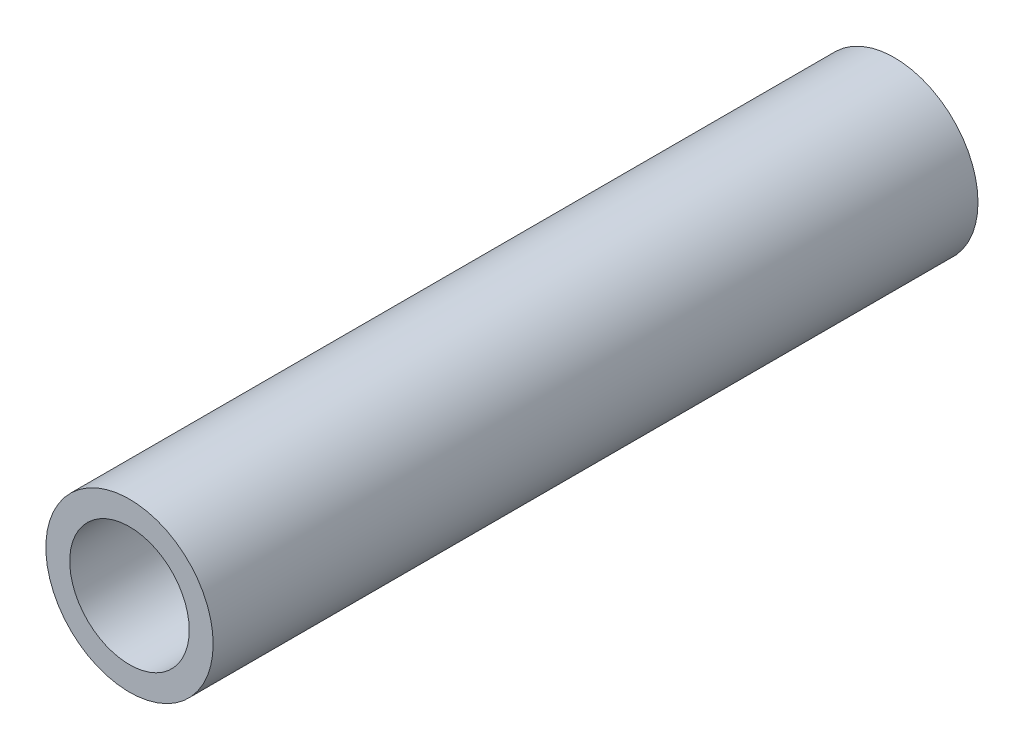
ISO-10303-21;
HEADER;
FILE_DESCRIPTION(('STEP AP214'),'2;1');
FILE_NAME('part.step','',(''),(''),'','','');
FILE_SCHEMA(('AUTOMOTIVE_DESIGN { 1 0 10303 214 1 1 1 1 }'));
ENDSEC;
DATA;
#1=APPLICATION_CONTEXT('core data for automotive mechanical design processes');
#2=APPLICATION_PROTOCOL_DEFINITION('international standard','automotive_design',2000,#1);
#3=PRODUCT_CONTEXT('',#1,'mechanical');
#4=PRODUCT('Part','Part','',(#3));
#5=PRODUCT_RELATED_PRODUCT_CATEGORY('part','',(#4));
#6=PRODUCT_DEFINITION_FORMATION('','',#4);
#7=PRODUCT_DEFINITION_CONTEXT('part definition',#1,'design');
#8=PRODUCT_DEFINITION('design','',#6,#7);
#9=PRODUCT_DEFINITION_SHAPE('','',#8);
#10=(LENGTH_UNIT() NAMED_UNIT(*) SI_UNIT(.MILLI.,.METRE.));
#11=(NAMED_UNIT(*) PLANE_ANGLE_UNIT() SI_UNIT($,.RADIAN.));
#12=(NAMED_UNIT(*) SI_UNIT($,.STERADIAN.) SOLID_ANGLE_UNIT());
#13=UNCERTAINTY_MEASURE_WITH_UNIT(LENGTH_MEASURE(1.E-05),#10,'distance_accuracy_value','');
#14=(GEOMETRIC_REPRESENTATION_CONTEXT(3) GLOBAL_UNCERTAINTY_ASSIGNED_CONTEXT((#13)) GLOBAL_UNIT_ASSIGNED_CONTEXT((#10,
#11,#12)) REPRESENTATION_CONTEXT('',''));
#15=CARTESIAN_POINT('',(0.,0.,0.));
#16=DIRECTION('',(0.,0.,1.));
#17=DIRECTION('',(1.,0.,0.));
#18=AXIS2_PLACEMENT_3D('',#15,#16,#17);
#19=CARTESIAN_POINT('',(0.,0.,101.6));
#20=DIRECTION('',(0.,0.,-1.));
#21=DIRECTION('',(-1.,0.,0.));
#22=AXIS2_PLACEMENT_3D('',#19,#20,#21);
#23=CYLINDRICAL_SURFACE('',#22,11.1125);
#24=CARTESIAN_POINT('',(0.,0.,101.6));
#25=DIRECTION('',(0.,0.,1.));
#26=DIRECTION('',(1.,0.,0.));
#27=AXIS2_PLACEMENT_3D('',#24,#25,#26);
#28=CIRCLE('',#27,11.1125);
#29=CARTESIAN_POINT('',(11.1125,0.,101.6));
#30=VERTEX_POINT('',#29);
#31=EDGE_CURVE('E10',#30,#30,#28,.T.);
#32=ORIENTED_EDGE('',*,*,#31,.F.);
#33=EDGE_LOOP('',(#32));
#34=FACE_BOUND('',#33,.T.);
#35=CARTESIAN_POINT('',(0.,0.,0.));
#36=DIRECTION('',(0.,0.,1.));
#37=DIRECTION('',(1.,0.,0.));
#38=AXIS2_PLACEMENT_3D('',#35,#36,#37);
#39=CIRCLE('',#38,11.1125);
#40=CARTESIAN_POINT('',(11.1125,0.,0.));
#41=VERTEX_POINT('',#40);
#42=EDGE_CURVE('E32',#41,#41,#39,.T.);
#43=ORIENTED_EDGE('',*,*,#42,.T.);
#44=EDGE_LOOP('',(#43));
#45=FACE_BOUND('',#44,.T.);
#46=ADVANCED_FACE('F29',(#34,#45),#23,.T.);
#47=CARTESIAN_POINT('',(0.,0.,101.6));
#48=DIRECTION('',(0.,0.,1.));
#49=DIRECTION('',(1.,0.,0.));
#50=AXIS2_PLACEMENT_3D('',#47,#48,#49);
#51=PLANE('',#50);
#52=CARTESIAN_POINT('',(0.,0.,101.6));
#53=DIRECTION('',(0.,0.,1.));
#54=DIRECTION('',(1.,0.,0.));
#55=AXIS2_PLACEMENT_3D('',#52,#53,#54);
#56=CIRCLE('',#55,7.9375);
#57=CARTESIAN_POINT('',(7.9375,0.,101.6));
#58=VERTEX_POINT('',#57);
#59=EDGE_CURVE('E41',#58,#58,#56,.T.);
#60=ORIENTED_EDGE('',*,*,#59,.F.);
#61=EDGE_LOOP('',(#60));
#62=FACE_BOUND('',#61,.T.);
#63=ORIENTED_EDGE('',*,*,#31,.T.);
#64=EDGE_LOOP('',(#63));
#65=FACE_BOUND('',#64,.T.);
#66=ADVANCED_FACE('F56',(#62,#65),#51,.T.);
#67=CARTESIAN_POINT('',(0.,0.,0.));
#68=DIRECTION('',(0.,0.,1.));
#69=DIRECTION('',(1.,0.,0.));
#70=AXIS2_PLACEMENT_3D('',#67,#68,#69);
#71=PLANE('',#70);
#72=CARTESIAN_POINT('',(0.,0.,0.));
#73=DIRECTION('',(0.,0.,1.));
#74=DIRECTION('',(1.,0.,0.));
#75=AXIS2_PLACEMENT_3D('',#72,#73,#74);
#76=CIRCLE('',#75,7.9375);
#77=CARTESIAN_POINT('',(7.9375,0.,0.));
#78=VERTEX_POINT('',#77);
#79=EDGE_CURVE('E39',#78,#78,#76,.T.);
#80=ORIENTED_EDGE('',*,*,#79,.T.);
#81=EDGE_LOOP('',(#80));
#82=FACE_BOUND('',#81,.T.);
#83=ORIENTED_EDGE('',*,*,#42,.F.);
#84=EDGE_LOOP('',(#83));
#85=FACE_BOUND('',#84,.T.);
#86=ADVANCED_FACE('F47',(#82,#85),#71,.F.);
#87=CARTESIAN_POINT('',(0.,0.,0.));
#88=DIRECTION('',(0.,0.,1.));
#89=DIRECTION('',(1.,0.,0.));
#90=AXIS2_PLACEMENT_3D('',#87,#88,#89);
#91=CYLINDRICAL_SURFACE('',#90,7.9375);
#92=ORIENTED_EDGE('',*,*,#79,.F.);
#93=EDGE_LOOP('',(#92));
#94=FACE_BOUND('',#93,.T.);
#95=ORIENTED_EDGE('',*,*,#59,.T.);
#96=EDGE_LOOP('',(#95));
#97=FACE_BOUND('',#96,.T.);
#98=ADVANCED_FACE('F50',(#94,#97),#91,.F.);
#99=CLOSED_SHELL('',(#46,#66,#86,#98));
#100=MANIFOLD_SOLID_BREP('B2',#99);
#101=ADVANCED_BREP_SHAPE_REPRESENTATION('',(#18,#100),#14);
#102=SHAPE_DEFINITION_REPRESENTATION(#9,#101);
ENDSEC;
END-ISO-10303-21;
